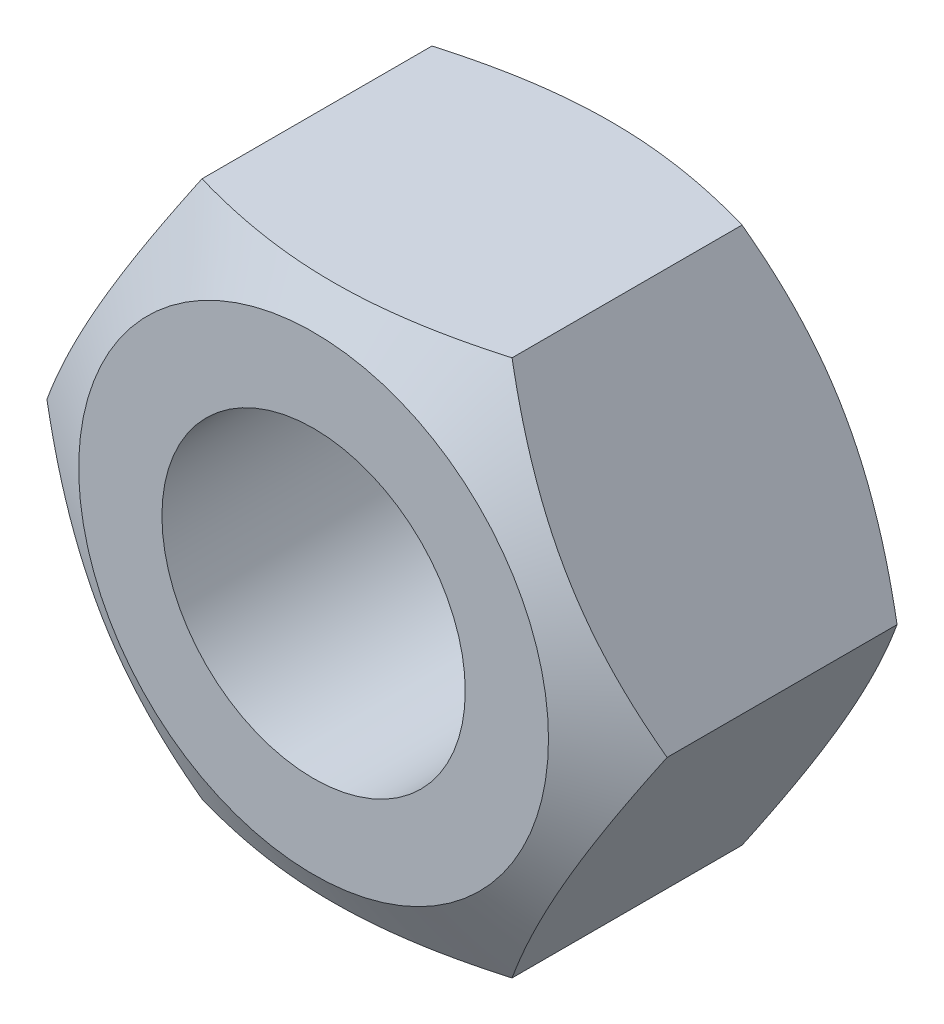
from build123d import *

# Parameters (mm, degrees)
ESQUISSE1_R             = 4.6
ESQUISSE1_R_2           = 2.25
BOSS_EXTRU_1_DEPTH      = 4.7
CHANFREIN1_SIZE         = 0.644
CHANFREIN1_SIZE2        = 1.11544072
ESQUISSE2_OUTSIDE_W     = 13.966
ESQUISSE2_OUTSIDE_H     = 13.966
ENL_V_MAT_EXTRU_1_DEPTH = 4.7


with BuildPart() as part:
    # Esquisse1 → Boss.-Extru.1 (new body)
    with BuildSketch(Plane.XY):
        Circle(ESQUISSE1_R)
        Circle(ESQUISSE1_R_2, mode=Mode.SUBTRACT)
    extrude(amount=BOSS_EXTRU_1_DEPTH)

    # Chanfrein1
    chanfrein1_edges = [part.edges().sort_by_distance(p)[0] for p in [
        (-4.6, 0, 0),
        (-4.6, 0, 4.7),
    ]]
    chanfrein1_side = [part.faces().sort_by_distance(p)[0] for p in [
        (-4.6, 0, 2.35),
    ]]
    chamfer(chanfrein1_edges, length=CHANFREIN1_SIZE, length2=CHANFREIN1_SIZE2, reference=chanfrein1_side[0])

    # Esquisse2 outside → Enl_v. mat.-Extru.1 (cut)
    with BuildSketch(Plane.XY.offset(4.7)):
        Rectangle(ESQUISSE2_OUTSIDE_W, ESQUISSE2_OUTSIDE_H)
        Polygon((4.6, 0), (2.3, 3.983716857), (-2.3, 3.983716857), (-4.6, 0), (-2.3, -3.983716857), (2.3, -3.983716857), align=None, mode=Mode.SUBTRACT)
    extrude(amount=-ENL_V_MAT_EXTRU_1_DEPTH, mode=Mode.SUBTRACT)


solid = part.part
